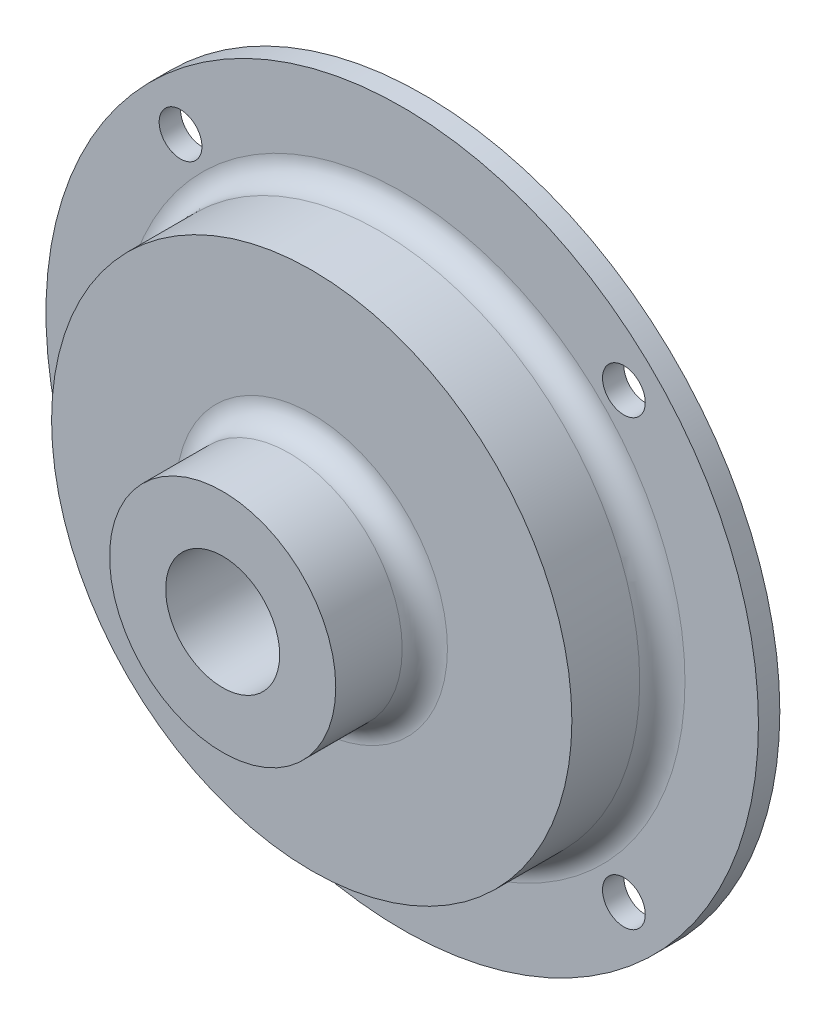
ISO-10303-21;
HEADER;
FILE_DESCRIPTION(('STEP AP214'),'2;1');
FILE_NAME('part.step','',(''),(''),'','','');
FILE_SCHEMA(('AUTOMOTIVE_DESIGN { 1 0 10303 214 1 1 1 1 }'));
ENDSEC;
DATA;
#1=APPLICATION_CONTEXT('core data for automotive mechanical design processes');
#2=APPLICATION_PROTOCOL_DEFINITION('international standard','automotive_design',2000,#1);
#3=PRODUCT_CONTEXT('',#1,'mechanical');
#4=PRODUCT('Part','Part','',(#3));
#5=PRODUCT_RELATED_PRODUCT_CATEGORY('part','',(#4));
#6=PRODUCT_DEFINITION_FORMATION('','',#4);
#7=PRODUCT_DEFINITION_CONTEXT('part definition',#1,'design');
#8=PRODUCT_DEFINITION('design','',#6,#7);
#9=PRODUCT_DEFINITION_SHAPE('','',#8);
#10=(LENGTH_UNIT() NAMED_UNIT(*) SI_UNIT(.MILLI.,.METRE.));
#11=(NAMED_UNIT(*) PLANE_ANGLE_UNIT() SI_UNIT($,.RADIAN.));
#12=(NAMED_UNIT(*) SI_UNIT($,.STERADIAN.) SOLID_ANGLE_UNIT());
#13=UNCERTAINTY_MEASURE_WITH_UNIT(LENGTH_MEASURE(1.E-05),#10,'distance_accuracy_value','');
#14=(GEOMETRIC_REPRESENTATION_CONTEXT(3) GLOBAL_UNCERTAINTY_ASSIGNED_CONTEXT((#13)) GLOBAL_UNIT_ASSIGNED_CONTEXT((#10,
#11,#12)) REPRESENTATION_CONTEXT('',''));
#15=CARTESIAN_POINT('',(0.,0.,0.));
#16=DIRECTION('',(0.,0.,1.));
#17=DIRECTION('',(1.,0.,0.));
#18=AXIS2_PLACEMENT_3D('',#15,#16,#17);
#19=CARTESIAN_POINT('',(0.,0.,15.7));
#20=DIRECTION('',(0.,0.,1.));
#21=DIRECTION('',(1.,0.,0.));
#22=AXIS2_PLACEMENT_3D('',#19,#20,#21);
#23=PLANE('',#22);
#24=CARTESIAN_POINT('',(0.,0.,15.7));
#25=DIRECTION('',(0.,0.,1.));
#26=DIRECTION('',(1.,0.,0.));
#27=AXIS2_PLACEMENT_3D('',#24,#25,#26);
#28=CIRCLE('',#27,19.05);
#29=CARTESIAN_POINT('',(19.05,0.,15.7));
#30=VERTEX_POINT('',#29);
#31=EDGE_CURVE('E48',#30,#30,#28,.F.);
#32=ORIENTED_EDGE('',*,*,#31,.T.);
#33=EDGE_LOOP('',(#32));
#34=FACE_BOUND('',#33,.T.);
#35=CARTESIAN_POINT('',(0.,0.,15.7));
#36=DIRECTION('',(0.,0.,1.));
#37=DIRECTION('',(1.,0.,0.));
#38=AXIS2_PLACEMENT_3D('',#35,#36,#37);
#39=CIRCLE('',#38,36.5125);
#40=CARTESIAN_POINT('',(36.5125,0.,15.7));
#41=VERTEX_POINT('',#40);
#42=EDGE_CURVE('E85',#41,#41,#39,.T.);
#43=ORIENTED_EDGE('',*,*,#42,.T.);
#44=EDGE_LOOP('',(#43));
#45=FACE_BOUND('',#44,.T.);
#46=ADVANCED_FACE('F37',(#34,#45),#23,.T.);
#47=CARTESIAN_POINT('',(0.,0.,3.));
#48=DIRECTION('',(0.,0.,1.));
#49=DIRECTION('',(1.,0.,0.));
#50=AXIS2_PLACEMENT_3D('',#47,#48,#49);
#51=PLANE('',#50);
#52=CARTESIAN_POINT('',(0.,0.,3.));
#53=DIRECTION('',(0.,0.,1.));
#54=DIRECTION('',(1.,0.,0.));
#55=AXIS2_PLACEMENT_3D('',#52,#53,#54);
#56=CIRCLE('',#55,39.6875);
#57=CARTESIAN_POINT('',(39.6875,0.,3.));
#58=VERTEX_POINT('',#57);
#59=EDGE_CURVE('E10',#58,#58,#56,.F.);
#60=ORIENTED_EDGE('',*,*,#59,.T.);
#61=EDGE_LOOP('',(#60));
#62=FACE_BOUND('',#61,.T.);
#63=CARTESIAN_POINT('',(-31.1126983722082,31.112698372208,3.));
#64=DIRECTION('',(0.,0.,1.));
#65=DIRECTION('',(1.,0.,0.));
#66=AXIS2_PLACEMENT_3D('',#63,#64,#65);
#67=CIRCLE('',#66,3.);
#68=CARTESIAN_POINT('',(-28.1126983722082,31.112698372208,3.));
#69=VERTEX_POINT('',#68);
#70=EDGE_CURVE('E79',#69,#69,#67,.T.);
#71=ORIENTED_EDGE('',*,*,#70,.F.);
#72=EDGE_LOOP('',(#71));
#73=FACE_BOUND('',#72,.T.);
#74=CARTESIAN_POINT('',(-31.112698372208,-31.1126983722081,3.));
#75=DIRECTION('',(0.,0.,1.));
#76=DIRECTION('',(1.,0.,0.));
#77=AXIS2_PLACEMENT_3D('',#74,#75,#76);
#78=CIRCLE('',#77,3.);
#79=CARTESIAN_POINT('',(-28.112698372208,-31.1126983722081,3.));
#80=VERTEX_POINT('',#79);
#81=EDGE_CURVE('E67',#80,#80,#78,.T.);
#82=ORIENTED_EDGE('',*,*,#81,.F.);
#83=EDGE_LOOP('',(#82));
#84=FACE_BOUND('',#83,.T.);
#85=CARTESIAN_POINT('',(0.,0.,3.));
#86=DIRECTION('',(0.,0.,1.));
#87=DIRECTION('',(1.,0.,0.));
#88=AXIS2_PLACEMENT_3D('',#85,#86,#87);
#89=CIRCLE('',#88,50.);
#90=CARTESIAN_POINT('',(50.,0.,3.));
#91=VERTEX_POINT('',#90);
#92=EDGE_CURVE('E57',#91,#91,#89,.T.);
#93=ORIENTED_EDGE('',*,*,#92,.T.);
#94=EDGE_LOOP('',(#93));
#95=FACE_BOUND('',#94,.T.);
#96=CARTESIAN_POINT('',(31.112698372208,31.1126983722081,3.));
#97=DIRECTION('',(0.,0.,1.));
#98=DIRECTION('',(1.,0.,0.));
#99=AXIS2_PLACEMENT_3D('',#96,#97,#98);
#100=CIRCLE('',#99,3.);
#101=CARTESIAN_POINT('',(34.112698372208,31.1126983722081,3.));
#102=VERTEX_POINT('',#101);
#103=EDGE_CURVE('E61',#102,#102,#100,.T.);
#104=ORIENTED_EDGE('',*,*,#103,.F.);
#105=EDGE_LOOP('',(#104));
#106=FACE_BOUND('',#105,.T.);
#107=CARTESIAN_POINT('',(31.1126983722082,-31.112698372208,3.));
#108=DIRECTION('',(0.,0.,1.));
#109=DIRECTION('',(1.,0.,0.));
#110=AXIS2_PLACEMENT_3D('',#107,#108,#109);
#111=CIRCLE('',#110,3.);
#112=CARTESIAN_POINT('',(34.1126983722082,-31.112698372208,3.));
#113=VERTEX_POINT('',#112);
#114=EDGE_CURVE('E73',#113,#113,#111,.T.);
#115=ORIENTED_EDGE('',*,*,#114,.F.);
#116=EDGE_LOOP('',(#115));
#117=FACE_BOUND('',#116,.T.);
#118=ADVANCED_FACE('F129',(#62,#73,#84,#95,#106,#117),#51,.T.);
#119=CARTESIAN_POINT('',(0.,0.,0.));
#120=DIRECTION('',(0.,0.,1.));
#121=DIRECTION('',(1.,0.,0.));
#122=AXIS2_PLACEMENT_3D('',#119,#120,#121);
#123=PLANE('',#122);
#124=CARTESIAN_POINT('',(0.,0.,0.));
#125=DIRECTION('',(0.,0.,1.));
#126=DIRECTION('',(1.,0.,0.));
#127=AXIS2_PLACEMENT_3D('',#124,#125,#126);
#128=CIRCLE('',#127,8.);
#129=CARTESIAN_POINT('',(8.,0.,0.));
#130=VERTEX_POINT('',#129);
#131=EDGE_CURVE('E93',#130,#130,#128,.T.);
#132=ORIENTED_EDGE('',*,*,#131,.T.);
#133=EDGE_LOOP('',(#132));
#134=FACE_BOUND('',#133,.T.);
#135=CARTESIAN_POINT('',(31.1126983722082,-31.112698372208,0.));
#136=DIRECTION('',(0.,0.,1.));
#137=DIRECTION('',(1.,0.,0.));
#138=AXIS2_PLACEMENT_3D('',#135,#136,#137);
#139=CIRCLE('',#138,3.);
#140=CARTESIAN_POINT('',(34.1126983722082,-31.112698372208,0.));
#141=VERTEX_POINT('',#140);
#142=EDGE_CURVE('E76',#141,#141,#139,.T.);
#143=ORIENTED_EDGE('',*,*,#142,.T.);
#144=EDGE_LOOP('',(#143));
#145=FACE_BOUND('',#144,.T.);
#146=CARTESIAN_POINT('',(31.112698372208,31.1126983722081,0.));
#147=DIRECTION('',(0.,0.,1.));
#148=DIRECTION('',(1.,0.,0.));
#149=AXIS2_PLACEMENT_3D('',#146,#147,#148);
#150=CIRCLE('',#149,3.);
#151=CARTESIAN_POINT('',(34.112698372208,31.1126983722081,0.));
#152=VERTEX_POINT('',#151);
#153=EDGE_CURVE('E64',#152,#152,#150,.T.);
#154=ORIENTED_EDGE('',*,*,#153,.T.);
#155=EDGE_LOOP('',(#154));
#156=FACE_BOUND('',#155,.T.);
#157=CARTESIAN_POINT('',(0.,0.,0.));
#158=DIRECTION('',(0.,0.,1.));
#159=DIRECTION('',(1.,0.,0.));
#160=AXIS2_PLACEMENT_3D('',#157,#158,#159);
#161=CIRCLE('',#160,50.);
#162=CARTESIAN_POINT('',(50.,0.,0.));
#163=VERTEX_POINT('',#162);
#164=EDGE_CURVE('E58',#163,#163,#161,.T.);
#165=ORIENTED_EDGE('',*,*,#164,.F.);
#166=EDGE_LOOP('',(#165));
#167=FACE_BOUND('',#166,.T.);
#168=CARTESIAN_POINT('',(-31.112698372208,-31.1126983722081,0.));
#169=DIRECTION('',(0.,0.,1.));
#170=DIRECTION('',(1.,0.,0.));
#171=AXIS2_PLACEMENT_3D('',#168,#169,#170);
#172=CIRCLE('',#171,3.);
#173=CARTESIAN_POINT('',(-28.112698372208,-31.1126983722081,0.));
#174=VERTEX_POINT('',#173);
#175=EDGE_CURVE('E70',#174,#174,#172,.T.);
#176=ORIENTED_EDGE('',*,*,#175,.T.);
#177=EDGE_LOOP('',(#176));
#178=FACE_BOUND('',#177,.T.);
#179=CARTESIAN_POINT('',(-31.1126983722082,31.112698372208,0.));
#180=DIRECTION('',(0.,0.,1.));
#181=DIRECTION('',(1.,0.,0.));
#182=AXIS2_PLACEMENT_3D('',#179,#180,#181);
#183=CIRCLE('',#182,3.);
#184=CARTESIAN_POINT('',(-28.1126983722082,31.112698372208,0.));
#185=VERTEX_POINT('',#184);
#186=EDGE_CURVE('E82',#185,#185,#183,.T.);
#187=ORIENTED_EDGE('',*,*,#186,.T.);
#188=EDGE_LOOP('',(#187));
#189=FACE_BOUND('',#188,.T.);
#190=ADVANCED_FACE('F100',(#134,#145,#156,#167,#178,#189),#123,.F.);
#191=CARTESIAN_POINT('',(0.,0.,3.));
#192=DIRECTION('',(0.,0.,-1.));
#193=DIRECTION('',(-1.,0.,0.));
#194=AXIS2_PLACEMENT_3D('',#191,#192,#193);
#195=CYLINDRICAL_SURFACE('',#194,50.);
#196=ORIENTED_EDGE('',*,*,#92,.F.);
#197=EDGE_LOOP('',(#196));
#198=FACE_BOUND('',#197,.T.);
#199=ORIENTED_EDGE('',*,*,#164,.T.);
#200=EDGE_LOOP('',(#199));
#201=FACE_BOUND('',#200,.T.);
#202=ADVANCED_FACE('F151',(#198,#201),#195,.T.);
#203=CARTESIAN_POINT('',(31.112698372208,31.1126983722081,3.));
#204=DIRECTION('',(0.,0.,-1.));
#205=DIRECTION('',(-1.,0.,0.));
#206=AXIS2_PLACEMENT_3D('',#203,#204,#205);
#207=CYLINDRICAL_SURFACE('',#206,3.);
#208=ORIENTED_EDGE('',*,*,#103,.T.);
#209=EDGE_LOOP('',(#208));
#210=FACE_BOUND('',#209,.T.);
#211=ORIENTED_EDGE('',*,*,#153,.F.);
#212=EDGE_LOOP('',(#211));
#213=FACE_BOUND('',#212,.T.);
#214=ADVANCED_FACE('F148',(#210,#213),#207,.F.);
#215=CARTESIAN_POINT('',(-31.112698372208,-31.1126983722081,3.));
#216=DIRECTION('',(0.,0.,-1.));
#217=DIRECTION('',(-1.,0.,0.));
#218=AXIS2_PLACEMENT_3D('',#215,#216,#217);
#219=CYLINDRICAL_SURFACE('',#218,3.);
#220=ORIENTED_EDGE('',*,*,#81,.T.);
#221=EDGE_LOOP('',(#220));
#222=FACE_BOUND('',#221,.T.);
#223=ORIENTED_EDGE('',*,*,#175,.F.);
#224=EDGE_LOOP('',(#223));
#225=FACE_BOUND('',#224,.T.);
#226=ADVANCED_FACE('F144',(#222,#225),#219,.F.);
#227=CARTESIAN_POINT('',(31.1126983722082,-31.112698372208,3.));
#228=DIRECTION('',(0.,0.,-1.));
#229=DIRECTION('',(-1.,0.,0.));
#230=AXIS2_PLACEMENT_3D('',#227,#228,#229);
#231=CYLINDRICAL_SURFACE('',#230,3.);
#232=ORIENTED_EDGE('',*,*,#114,.T.);
#233=EDGE_LOOP('',(#232));
#234=FACE_BOUND('',#233,.T.);
#235=ORIENTED_EDGE('',*,*,#142,.F.);
#236=EDGE_LOOP('',(#235));
#237=FACE_BOUND('',#236,.T.);
#238=ADVANCED_FACE('F140',(#234,#237),#231,.F.);
#239=CARTESIAN_POINT('',(-31.1126983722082,31.112698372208,3.));
#240=DIRECTION('',(0.,0.,-1.));
#241=DIRECTION('',(-1.,0.,0.));
#242=AXIS2_PLACEMENT_3D('',#239,#240,#241);
#243=CYLINDRICAL_SURFACE('',#242,3.);
#244=ORIENTED_EDGE('',*,*,#70,.T.);
#245=EDGE_LOOP('',(#244));
#246=FACE_BOUND('',#245,.T.);
#247=ORIENTED_EDGE('',*,*,#186,.F.);
#248=EDGE_LOOP('',(#247));
#249=FACE_BOUND('',#248,.T.);
#250=ADVANCED_FACE('F125',(#246,#249),#243,.F.);
#251=CARTESIAN_POINT('',(0.,0.,15.7));
#252=DIRECTION('',(0.,0.,-1.));
#253=DIRECTION('',(-1.,0.,0.));
#254=AXIS2_PLACEMENT_3D('',#251,#252,#253);
#255=CYLINDRICAL_SURFACE('',#254,36.5125);
#256=CARTESIAN_POINT('',(0.,0.,6.175));
#257=DIRECTION('',(0.,0.,1.));
#258=DIRECTION('',(1.,0.,0.));
#259=AXIS2_PLACEMENT_3D('',#256,#257,#258);
#260=CIRCLE('',#259,36.5125);
#261=CARTESIAN_POINT('',(36.5125,0.,6.175));
#262=VERTEX_POINT('',#261);
#263=EDGE_CURVE('E44',#262,#262,#260,.T.);
#264=ORIENTED_EDGE('',*,*,#263,.T.);
#265=EDGE_LOOP('',(#264));
#266=FACE_BOUND('',#265,.T.);
#267=ORIENTED_EDGE('',*,*,#42,.F.);
#268=EDGE_LOOP('',(#267));
#269=FACE_BOUND('',#268,.T.);
#270=ADVANCED_FACE('F118',(#266,#269),#255,.T.);
#271=CARTESIAN_POINT('',(0.,0.,28.2));
#272=DIRECTION('',(0.,0.,-1.));
#273=DIRECTION('',(-1.,0.,0.));
#274=AXIS2_PLACEMENT_3D('',#271,#272,#273);
#275=CYLINDRICAL_SURFACE('',#274,15.875);
#276=CARTESIAN_POINT('',(0.,0.,18.875));
#277=DIRECTION('',(0.,0.,1.));
#278=DIRECTION('',(1.,0.,0.));
#279=AXIS2_PLACEMENT_3D('',#276,#277,#278);
#280=CIRCLE('',#279,15.875);
#281=CARTESIAN_POINT('',(15.875,0.,18.875));
#282=VERTEX_POINT('',#281);
#283=EDGE_CURVE('E52',#282,#282,#280,.T.);
#284=ORIENTED_EDGE('',*,*,#283,.T.);
#285=EDGE_LOOP('',(#284));
#286=FACE_BOUND('',#285,.T.);
#287=CARTESIAN_POINT('',(0.,0.,28.2));
#288=DIRECTION('',(0.,0.,1.));
#289=DIRECTION('',(1.,0.,0.));
#290=AXIS2_PLACEMENT_3D('',#287,#288,#289);
#291=CIRCLE('',#290,15.875);
#292=CARTESIAN_POINT('',(15.875,0.,28.2));
#293=VERTEX_POINT('',#292);
#294=EDGE_CURVE('E90',#293,#293,#291,.T.);
#295=ORIENTED_EDGE('',*,*,#294,.F.);
#296=EDGE_LOOP('',(#295));
#297=FACE_BOUND('',#296,.T.);
#298=ADVANCED_FACE('F113',(#286,#297),#275,.T.);
#299=CARTESIAN_POINT('',(0.,0.,28.2));
#300=DIRECTION('',(0.,0.,1.));
#301=DIRECTION('',(1.,0.,0.));
#302=AXIS2_PLACEMENT_3D('',#299,#300,#301);
#303=PLANE('',#302);
#304=CARTESIAN_POINT('',(0.,0.,28.2));
#305=DIRECTION('',(0.,0.,1.));
#306=DIRECTION('',(1.,0.,0.));
#307=AXIS2_PLACEMENT_3D('',#304,#305,#306);
#308=CIRCLE('',#307,8.);
#309=CARTESIAN_POINT('',(8.,0.,28.2));
#310=VERTEX_POINT('',#309);
#311=EDGE_CURVE('E94',#310,#310,#308,.T.);
#312=ORIENTED_EDGE('',*,*,#311,.F.);
#313=EDGE_LOOP('',(#312));
#314=FACE_BOUND('',#313,.T.);
#315=ORIENTED_EDGE('',*,*,#294,.T.);
#316=EDGE_LOOP('',(#315));
#317=FACE_BOUND('',#316,.T.);
#318=ADVANCED_FACE('F109',(#314,#317),#303,.T.);
#319=CARTESIAN_POINT('',(0.,0.,18.875));
#320=DIRECTION('',(0.,0.,1.));
#321=DIRECTION('',(1.,0.,0.));
#322=AXIS2_PLACEMENT_3D('',#319,#320,#321);
#323=TOROIDAL_SURFACE('',#322,19.05,3.175);
#324=ORIENTED_EDGE('',*,*,#31,.F.);
#325=EDGE_LOOP('',(#324));
#326=FACE_BOUND('',#325,.T.);
#327=ORIENTED_EDGE('',*,*,#283,.F.);
#328=EDGE_LOOP('',(#327));
#329=FACE_BOUND('',#328,.T.);
#330=ADVANCED_FACE('F112',(#326,#329),#323,.F.);
#331=CARTESIAN_POINT('',(0.,0.,6.175));
#332=DIRECTION('',(0.,0.,1.));
#333=DIRECTION('',(1.,0.,0.));
#334=AXIS2_PLACEMENT_3D('',#331,#332,#333);
#335=TOROIDAL_SURFACE('',#334,39.6875,3.175);
#336=ORIENTED_EDGE('',*,*,#59,.F.);
#337=EDGE_LOOP('',(#336));
#338=FACE_BOUND('',#337,.T.);
#339=ORIENTED_EDGE('',*,*,#263,.F.);
#340=EDGE_LOOP('',(#339));
#341=FACE_BOUND('',#340,.T.);
#342=ADVANCED_FACE('F39',(#338,#341),#335,.F.);
#343=CARTESIAN_POINT('',(0.,0.,0.));
#344=DIRECTION('',(0.,0.,1.));
#345=DIRECTION('',(1.,0.,0.));
#346=AXIS2_PLACEMENT_3D('',#343,#344,#345);
#347=CYLINDRICAL_SURFACE('',#346,8.);
#348=ORIENTED_EDGE('',*,*,#131,.F.);
#349=EDGE_LOOP('',(#348));
#350=FACE_BOUND('',#349,.T.);
#351=ORIENTED_EDGE('',*,*,#311,.T.);
#352=EDGE_LOOP('',(#351));
#353=FACE_BOUND('',#352,.T.);
#354=ADVANCED_FACE('F103',(#350,#353),#347,.F.);
#355=CLOSED_SHELL('',(#46,#118,#190,#202,#214,#226,#238,#250,#270,#298,#318,#330,#342,#354));
#356=MANIFOLD_SOLID_BREP('B2',#355);
#357=ADVANCED_BREP_SHAPE_REPRESENTATION('',(#18,#356),#14);
#358=SHAPE_DEFINITION_REPRESENTATION(#9,#357);
ENDSEC;
END-ISO-10303-21;
